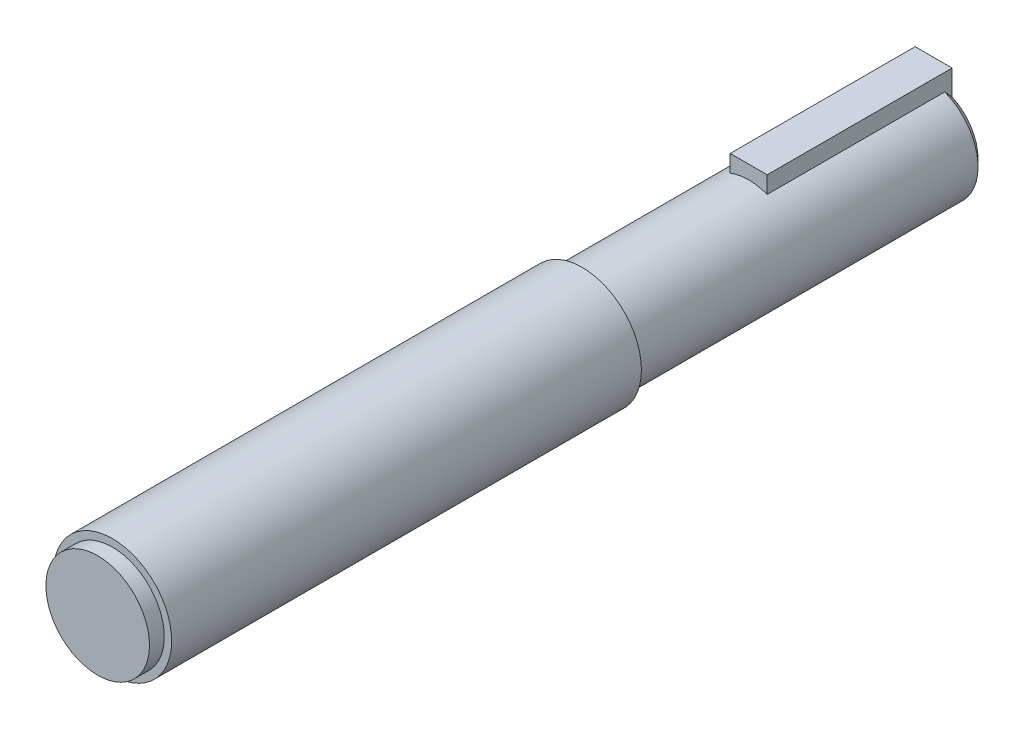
ISO-10303-21;
HEADER;
FILE_DESCRIPTION(('STEP AP214'),'2;1');
FILE_NAME('part.step','',(''),(''),'','','');
FILE_SCHEMA(('AUTOMOTIVE_DESIGN { 1 0 10303 214 1 1 1 1 }'));
ENDSEC;
DATA;
#1=APPLICATION_CONTEXT('core data for automotive mechanical design processes');
#2=APPLICATION_PROTOCOL_DEFINITION('international standard','automotive_design',2000,#1);
#3=PRODUCT_CONTEXT('',#1,'mechanical');
#4=PRODUCT('Part','Part','',(#3));
#5=PRODUCT_RELATED_PRODUCT_CATEGORY('part','',(#4));
#6=PRODUCT_DEFINITION_FORMATION('','',#4);
#7=PRODUCT_DEFINITION_CONTEXT('part definition',#1,'design');
#8=PRODUCT_DEFINITION('design','',#6,#7);
#9=PRODUCT_DEFINITION_SHAPE('','',#8);
#10=(LENGTH_UNIT() NAMED_UNIT(*) SI_UNIT(.MILLI.,.METRE.));
#11=(NAMED_UNIT(*) PLANE_ANGLE_UNIT() SI_UNIT($,.RADIAN.));
#12=(NAMED_UNIT(*) SI_UNIT($,.STERADIAN.) SOLID_ANGLE_UNIT());
#13=UNCERTAINTY_MEASURE_WITH_UNIT(LENGTH_MEASURE(1.E-05),#10,'distance_accuracy_value','');
#14=(GEOMETRIC_REPRESENTATION_CONTEXT(3) GLOBAL_UNCERTAINTY_ASSIGNED_CONTEXT((#13)) GLOBAL_UNIT_ASSIGNED_CONTEXT((#10,
#11,#12)) REPRESENTATION_CONTEXT('',''));
#15=CARTESIAN_POINT('',(0.,0.,0.));
#16=DIRECTION('',(0.,0.,1.));
#17=DIRECTION('',(1.,0.,0.));
#18=AXIS2_PLACEMENT_3D('',#15,#16,#17);
#19=CARTESIAN_POINT('',(0.,0.,111.));
#20=DIRECTION('',(0.,0.,1.));
#21=DIRECTION('',(1.,0.,0.));
#22=AXIS2_PLACEMENT_3D('',#19,#20,#21);
#23=PLANE('',#22);
#24=CARTESIAN_POINT('',(0.,0.,111.));
#25=DIRECTION('',(0.,0.,1.));
#26=DIRECTION('',(1.,0.,0.));
#27=AXIS2_PLACEMENT_3D('',#24,#25,#26);
#28=CIRCLE('',#27,8.);
#29=CARTESIAN_POINT('',(8.,0.,111.));
#30=VERTEX_POINT('',#29);
#31=EDGE_CURVE('E123',#30,#30,#28,.T.);
#32=ORIENTED_EDGE('',*,*,#31,.T.);
#33=EDGE_LOOP('',(#32));
#34=FACE_BOUND('',#33,.T.);
#35=CARTESIAN_POINT('',(0.,0.,111.));
#36=DIRECTION('',(0.,0.,1.));
#37=DIRECTION('',(1.,0.,0.));
#38=AXIS2_PLACEMENT_3D('',#35,#36,#37);
#39=CIRCLE('',#38,7.);
#40=CARTESIAN_POINT('',(7.,0.,111.));
#41=VERTEX_POINT('',#40);
#42=EDGE_CURVE('E171',#41,#41,#39,.T.);
#43=ORIENTED_EDGE('',*,*,#42,.F.);
#44=EDGE_LOOP('',(#43));
#45=FACE_BOUND('',#44,.T.);
#46=ADVANCED_FACE('F35',(#34,#45),#23,.T.);
#47=CARTESIAN_POINT('',(0.,0.,47.5));
#48=DIRECTION('',(0.,0.,-1.));
#49=DIRECTION('',(-1.,0.,0.));
#50=AXIS2_PLACEMENT_3D('',#47,#48,#49);
#51=CYLINDRICAL_SURFACE('',#50,7.);
#52=CARTESIAN_POINT('',(0.,0.,47.5));
#53=DIRECTION('',(0.,0.,1.));
#54=DIRECTION('',(1.,0.,0.));
#55=AXIS2_PLACEMENT_3D('',#52,#53,#54);
#56=CIRCLE('',#55,7.);
#57=CARTESIAN_POINT('',(7.,0.,47.5));
#58=VERTEX_POINT('',#57);
#59=EDGE_CURVE('E126',#58,#58,#56,.T.);
#60=ORIENTED_EDGE('',*,*,#59,.F.);
#61=EDGE_LOOP('',(#60));
#62=FACE_BOUND('',#61,.T.);
#63=DIRECTION('',(0.,0.,-1.));
#64=VECTOR('',#63,1.);
#65=CARTESIAN_POINT('',(-2.5,6.53834841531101,25.));
#66=LINE('',#65,#64);
#67=CARTESIAN_POINT('',(-2.5,6.53834841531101,25.));
#68=VERTEX_POINT('',#67);
#69=CARTESIAN_POINT('',(-2.5,6.53834841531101,0.999999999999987));
#70=VERTEX_POINT('',#69);
#71=EDGE_CURVE('E92',#68,#70,#66,.T.);
#72=ORIENTED_EDGE('',*,*,#71,.T.);
#73=CARTESIAN_POINT('',(0.,0.,0.999999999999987));
#74=DIRECTION('',(0.,0.,1.));
#75=DIRECTION('',(1.,0.,0.));
#76=AXIS2_PLACEMENT_3D('',#73,#74,#75);
#77=CIRCLE('',#76,7.);
#78=CARTESIAN_POINT('',(2.5,6.53834841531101,0.999999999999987));
#79=VERTEX_POINT('',#78);
#80=EDGE_CURVE('E131',#70,#79,#77,.T.);
#81=ORIENTED_EDGE('',*,*,#80,.T.);
#82=DIRECTION('',(0.,0.,-1.));
#83=VECTOR('',#82,1.);
#84=CARTESIAN_POINT('',(2.5,6.53834841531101,25.));
#85=LINE('',#84,#83);
#86=CARTESIAN_POINT('',(2.5,6.53834841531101,25.));
#87=VERTEX_POINT('',#86);
#88=EDGE_CURVE('E118',#87,#79,#85,.T.);
#89=ORIENTED_EDGE('',*,*,#88,.F.);
#90=CARTESIAN_POINT('',(0.,0.,25.));
#91=DIRECTION('',(0.,0.,-1.));
#92=DIRECTION('',(-1.,0.,0.));
#93=AXIS2_PLACEMENT_3D('',#90,#91,#92);
#94=CIRCLE('',#93,7.);
#95=EDGE_CURVE('E115',#68,#87,#94,.T.);
#96=ORIENTED_EDGE('',*,*,#95,.F.);
#97=EDGE_LOOP('',(#72,#81,#89,#96));
#98=FACE_BOUND('',#97,.T.);
#99=ADVANCED_FACE('F148',(#62,#98),#51,.T.);
#100=CARTESIAN_POINT('',(0.,0.,0.));
#101=DIRECTION('',(0.,0.,1.));
#102=DIRECTION('',(1.,0.,0.));
#103=AXIS2_PLACEMENT_3D('',#100,#101,#102);
#104=PLANE('',#103);
#105=DIRECTION('',(0.,-1.,0.));
#106=VECTOR('',#105,1.);
#107=CARTESIAN_POINT('',(2.5,3.83834841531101,0.));
#108=LINE('',#107,#106);
#109=CARTESIAN_POINT('',(2.5,8.83834841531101,0.));
#110=VERTEX_POINT('',#109);
#111=CARTESIAN_POINT('',(2.5,5.45435605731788,0.));
#112=VERTEX_POINT('',#111);
#113=EDGE_CURVE('E55',#110,#112,#108,.T.);
#114=ORIENTED_EDGE('',*,*,#113,.T.);
#115=CARTESIAN_POINT('',(0.,0.,0.));
#116=DIRECTION('',(0.,0.,1.));
#117=DIRECTION('',(1.,0.,0.));
#118=AXIS2_PLACEMENT_3D('',#115,#116,#117);
#119=CIRCLE('',#118,6.00000000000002);
#120=CARTESIAN_POINT('',(-2.5,5.45435605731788,0.));
#121=VERTEX_POINT('',#120);
#122=EDGE_CURVE('E134',#112,#121,#119,.F.);
#123=ORIENTED_EDGE('',*,*,#122,.T.);
#124=DIRECTION('',(0.,1.,0.));
#125=VECTOR('',#124,1.);
#126=CARTESIAN_POINT('',(-2.5,3.83834841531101,0.));
#127=LINE('',#126,#125);
#128=CARTESIAN_POINT('',(-2.5,8.83834841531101,0.));
#129=VERTEX_POINT('',#128);
#130=EDGE_CURVE('E62',#121,#129,#127,.T.);
#131=ORIENTED_EDGE('',*,*,#130,.T.);
#132=DIRECTION('',(1.,0.,0.));
#133=VECTOR('',#132,1.);
#134=CARTESIAN_POINT('',(2.5,8.83834841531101,0.));
#135=LINE('',#134,#133);
#136=EDGE_CURVE('E102',#129,#110,#135,.T.);
#137=ORIENTED_EDGE('',*,*,#136,.T.);
#138=EDGE_LOOP('',(#114,#123,#131,#137));
#139=FACE_BOUND('',#138,.T.);
#140=ADVANCED_FACE('F154',(#139),#104,.F.);
#141=CARTESIAN_POINT('',(0.,0.,47.5));
#142=DIRECTION('',(0.,0.,1.));
#143=DIRECTION('',(1.,0.,0.));
#144=AXIS2_PLACEMENT_3D('',#141,#142,#143);
#145=PLANE('',#144);
#146=CARTESIAN_POINT('',(0.,0.,47.5));
#147=DIRECTION('',(0.,0.,1.));
#148=DIRECTION('',(1.,0.,0.));
#149=AXIS2_PLACEMENT_3D('',#146,#147,#148);
#150=CIRCLE('',#149,8.);
#151=CARTESIAN_POINT('',(8.,0.,47.5));
#152=VERTEX_POINT('',#151);
#153=EDGE_CURVE('E120',#152,#152,#150,.T.);
#154=ORIENTED_EDGE('',*,*,#153,.F.);
#155=EDGE_LOOP('',(#154));
#156=FACE_BOUND('',#155,.T.);
#157=ORIENTED_EDGE('',*,*,#59,.T.);
#158=EDGE_LOOP('',(#157));
#159=FACE_BOUND('',#158,.T.);
#160=ADVANCED_FACE('F150',(#156,#159),#145,.F.);
#161=CARTESIAN_POINT('',(0.,0.,111.));
#162=DIRECTION('',(0.,0.,-1.));
#163=DIRECTION('',(-1.,0.,0.));
#164=AXIS2_PLACEMENT_3D('',#161,#162,#163);
#165=CYLINDRICAL_SURFACE('',#164,8.);
#166=ORIENTED_EDGE('',*,*,#31,.F.);
#167=EDGE_LOOP('',(#166));
#168=FACE_BOUND('',#167,.T.);
#169=ORIENTED_EDGE('',*,*,#153,.T.);
#170=EDGE_LOOP('',(#169));
#171=FACE_BOUND('',#170,.T.);
#172=ADVANCED_FACE('F153',(#168,#171),#165,.T.);
#173=CARTESIAN_POINT('',(0.,0.,25.));
#174=DIRECTION('',(0.,0.,1.));
#175=DIRECTION('',(1.,0.,0.));
#176=AXIS2_PLACEMENT_3D('',#173,#174,#175);
#177=PLANE('',#176);
#178=ORIENTED_EDGE('',*,*,#95,.T.);
#179=DIRECTION('',(0.,-1.,0.));
#180=VECTOR('',#179,1.);
#181=CARTESIAN_POINT('',(2.5,3.83834841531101,25.));
#182=LINE('',#181,#180);
#183=CARTESIAN_POINT('',(2.5,8.83834841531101,25.));
#184=VERTEX_POINT('',#183);
#185=EDGE_CURVE('E97',#184,#87,#182,.T.);
#186=ORIENTED_EDGE('',*,*,#185,.F.);
#187=DIRECTION('',(1.,0.,0.));
#188=VECTOR('',#187,1.);
#189=CARTESIAN_POINT('',(2.5,8.83834841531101,25.));
#190=LINE('',#189,#188);
#191=CARTESIAN_POINT('',(-2.5,8.83834841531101,25.));
#192=VERTEX_POINT('',#191);
#193=EDGE_CURVE('E96',#192,#184,#190,.T.);
#194=ORIENTED_EDGE('',*,*,#193,.F.);
#195=DIRECTION('',(0.,1.,0.));
#196=VECTOR('',#195,1.);
#197=CARTESIAN_POINT('',(-2.5,3.83834841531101,25.));
#198=LINE('',#197,#196);
#199=EDGE_CURVE('E86',#68,#192,#198,.T.);
#200=ORIENTED_EDGE('',*,*,#199,.F.);
#201=EDGE_LOOP('',(#178,#186,#194,#200));
#202=FACE_BOUND('',#201,.T.);
#203=ADVANCED_FACE('F106',(#202),#177,.T.);
#204=CARTESIAN_POINT('',(2.5,3.83834841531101,25.));
#205=DIRECTION('',(1.,0.,0.));
#206=DIRECTION('',(0.,0.,-1.));
#207=AXIS2_PLACEMENT_3D('',#204,#205,#206);
#208=PLANE('',#207);
#209=ORIENTED_EDGE('',*,*,#88,.T.);
#210=CARTESIAN_POINT('',(2.5,6.53834841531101,0.999999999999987));
#211=CARTESIAN_POINT('',(2.5,6.44853197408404,0.91610847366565));
#212=CARTESIAN_POINT('',(2.5,6.35860694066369,0.832333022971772));
#213=CARTESIAN_POINT('',(2.5,6.178510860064,0.665049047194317));
#214=CARTESIAN_POINT('',(2.5,6.0883398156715,0.581540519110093));
#215=CARTESIAN_POINT('',(2.5,5.90772063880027,0.414823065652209));
#216=CARTESIAN_POINT('',(2.5,5.81727250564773,0.331614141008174));
#217=CARTESIAN_POINT('',(2.5,5.63606039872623,0.165538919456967));
#218=CARTESIAN_POINT('',(2.5,5.54529642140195,0.08267262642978));
#219=CARTESIAN_POINT('',(2.5,5.45435605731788,0.));
#220=B_SPLINE_CURVE_WITH_KNOTS('',3,(#210,#211,#212,#213,#214,#215,#216,#217,#218,#219),
.UNSPECIFIED.,.F.,.F.,(4,2,2,2,4),(0.,0.368704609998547,0.737405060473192,1.10610640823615,
1.47481191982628),.UNSPECIFIED.);
#221=EDGE_CURVE('E48',#79,#112,#220,.T.);
#222=ORIENTED_EDGE('',*,*,#221,.T.);
#223=ORIENTED_EDGE('',*,*,#113,.F.);
#224=DIRECTION('',(0.,0.,-1.));
#225=VECTOR('',#224,1.);
#226=CARTESIAN_POINT('',(2.5,8.83834841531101,25.));
#227=LINE('',#226,#225);
#228=EDGE_CURVE('E103',#184,#110,#227,.T.);
#229=ORIENTED_EDGE('',*,*,#228,.F.);
#230=ORIENTED_EDGE('',*,*,#185,.T.);
#231=EDGE_LOOP('',(#209,#222,#223,#229,#230));
#232=FACE_BOUND('',#231,.T.);
#233=ADVANCED_FACE('F139',(#232),#208,.T.);
#234=CARTESIAN_POINT('',(-2.5,3.83834841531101,25.));
#235=DIRECTION('',(-1.,0.,0.));
#236=DIRECTION('',(0.,0.,1.));
#237=AXIS2_PLACEMENT_3D('',#234,#235,#236);
#238=PLANE('',#237);
#239=ORIENTED_EDGE('',*,*,#71,.F.);
#240=ORIENTED_EDGE('',*,*,#199,.T.);
#241=DIRECTION('',(0.,0.,-1.));
#242=VECTOR('',#241,1.);
#243=CARTESIAN_POINT('',(-2.5,8.83834841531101,25.));
#244=LINE('',#243,#242);
#245=EDGE_CURVE('E89',#192,#129,#244,.T.);
#246=ORIENTED_EDGE('',*,*,#245,.T.);
#247=ORIENTED_EDGE('',*,*,#130,.F.);
#248=CARTESIAN_POINT('',(-2.5,5.45435605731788,0.));
#249=CARTESIAN_POINT('',(-2.5,5.54529642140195,0.082672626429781));
#250=CARTESIAN_POINT('',(-2.5,5.63606039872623,0.165538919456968));
#251=CARTESIAN_POINT('',(-2.5,5.81727250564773,0.331614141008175));
#252=CARTESIAN_POINT('',(-2.5,5.90772063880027,0.41482306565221));
#253=CARTESIAN_POINT('',(-2.5,6.08833981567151,0.581540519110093));
#254=CARTESIAN_POINT('',(-2.5,6.178510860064,0.665049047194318));
#255=CARTESIAN_POINT('',(-2.5,6.35860694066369,0.832333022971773));
#256=CARTESIAN_POINT('',(-2.5,6.44853197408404,0.916108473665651));
#257=CARTESIAN_POINT('',(-2.5,6.53834841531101,0.999999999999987));
#258=B_SPLINE_CURVE_WITH_KNOTS('',3,(#248,#249,#250,#251,#252,#253,#254,#255,#256,#257),
.UNSPECIFIED.,.F.,.F.,(4,2,2,2,4),(0.,0.368705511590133,0.737406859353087,1.10610730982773,
1.47481191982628),.UNSPECIFIED.);
#259=EDGE_CURVE('E11',#121,#70,#258,.T.);
#260=ORIENTED_EDGE('',*,*,#259,.T.);
#261=EDGE_LOOP('',(#239,#240,#246,#247,#260));
#262=FACE_BOUND('',#261,.T.);
#263=ADVANCED_FACE('F88',(#262),#238,.T.);
#264=CARTESIAN_POINT('',(2.5,8.83834841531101,25.));
#265=DIRECTION('',(0.,1.,0.));
#266=DIRECTION('',(0.,0.,1.));
#267=AXIS2_PLACEMENT_3D('',#264,#265,#266);
#268=PLANE('',#267);
#269=ORIENTED_EDGE('',*,*,#136,.F.);
#270=ORIENTED_EDGE('',*,*,#245,.F.);
#271=ORIENTED_EDGE('',*,*,#193,.T.);
#272=ORIENTED_EDGE('',*,*,#228,.T.);
#273=EDGE_LOOP('',(#269,#270,#271,#272));
#274=FACE_BOUND('',#273,.T.);
#275=ADVANCED_FACE('F101',(#274),#268,.T.);
#276=CARTESIAN_POINT('',(0.,0.,113.));
#277=DIRECTION('',(0.,0.,-1.));
#278=DIRECTION('',(-1.,0.,0.));
#279=AXIS2_PLACEMENT_3D('',#276,#277,#278);
#280=CYLINDRICAL_SURFACE('',#279,7.);
#281=CARTESIAN_POINT('',(0.,0.,113.));
#282=DIRECTION('',(0.,0.,1.));
#283=DIRECTION('',(1.,0.,0.));
#284=AXIS2_PLACEMENT_3D('',#281,#282,#283);
#285=CIRCLE('',#284,7.);
#286=CARTESIAN_POINT('',(7.,0.,113.));
#287=VERTEX_POINT('',#286);
#288=EDGE_CURVE('E112',#287,#287,#285,.T.);
#289=ORIENTED_EDGE('',*,*,#288,.F.);
#290=EDGE_LOOP('',(#289));
#291=FACE_BOUND('',#290,.T.);
#292=ORIENTED_EDGE('',*,*,#42,.T.);
#293=EDGE_LOOP('',(#292));
#294=FACE_BOUND('',#293,.T.);
#295=ADVANCED_FACE('F179',(#291,#294),#280,.T.);
#296=CARTESIAN_POINT('',(0.,0.,113.));
#297=DIRECTION('',(0.,0.,1.));
#298=DIRECTION('',(1.,0.,0.));
#299=AXIS2_PLACEMENT_3D('',#296,#297,#298);
#300=PLANE('',#299);
#301=ORIENTED_EDGE('',*,*,#288,.T.);
#302=EDGE_LOOP('',(#301));
#303=FACE_BOUND('',#302,.T.);
#304=ADVANCED_FACE('F177',(#303),#300,.T.);
#305=CARTESIAN_POINT('',(0.,0.,0.999999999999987));
#306=DIRECTION('',(0.,0.,1.));
#307=DIRECTION('',(1.,0.,0.));
#308=AXIS2_PLACEMENT_3D('',#305,#306,#307);
#309=CONICAL_SURFACE('',#308,7.,0.785398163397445);
#310=ORIENTED_EDGE('',*,*,#259,.F.);
#311=ORIENTED_EDGE('',*,*,#122,.F.);
#312=ORIENTED_EDGE('',*,*,#221,.F.);
#313=ORIENTED_EDGE('',*,*,#80,.F.);
#314=EDGE_LOOP('',(#310,#311,#312,#313));
#315=FACE_BOUND('',#314,.T.);
#316=ADVANCED_FACE('F37',(#315),#309,.T.);
#317=CLOSED_SHELL('',(#46,#99,#140,#160,#172,#203,#233,#263,#275,#295,#304,#316));
#318=MANIFOLD_SOLID_BREP('B2',#317);
#319=ADVANCED_BREP_SHAPE_REPRESENTATION('',(#18,#318),#14);
#320=SHAPE_DEFINITION_REPRESENTATION(#9,#319);
ENDSEC;
END-ISO-10303-21;
